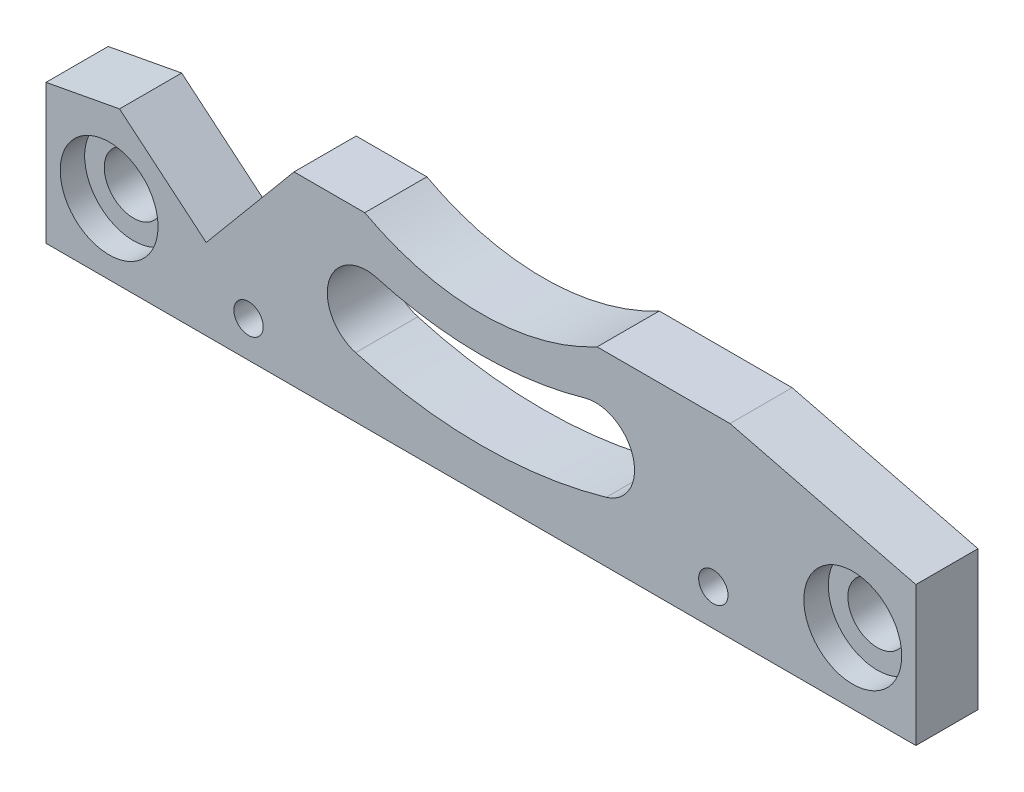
ISO-10303-21;
HEADER;
FILE_DESCRIPTION(('STEP AP214'),'2;1');
FILE_NAME('part.step','',(''),(''),'','','');
FILE_SCHEMA(('AUTOMOTIVE_DESIGN { 1 0 10303 214 1 1 1 1 }'));
ENDSEC;
DATA;
#1=APPLICATION_CONTEXT('core data for automotive mechanical design processes');
#2=APPLICATION_PROTOCOL_DEFINITION('international standard','automotive_design',2000,#1);
#3=PRODUCT_CONTEXT('',#1,'mechanical');
#4=PRODUCT('Part','Part','',(#3));
#5=PRODUCT_RELATED_PRODUCT_CATEGORY('part','',(#4));
#6=PRODUCT_DEFINITION_FORMATION('','',#4);
#7=PRODUCT_DEFINITION_CONTEXT('part definition',#1,'design');
#8=PRODUCT_DEFINITION('design','',#6,#7);
#9=PRODUCT_DEFINITION_SHAPE('','',#8);
#10=(LENGTH_UNIT() NAMED_UNIT(*) SI_UNIT(.MILLI.,.METRE.));
#11=(NAMED_UNIT(*) PLANE_ANGLE_UNIT() SI_UNIT($,.RADIAN.));
#12=(NAMED_UNIT(*) SI_UNIT($,.STERADIAN.) SOLID_ANGLE_UNIT());
#13=UNCERTAINTY_MEASURE_WITH_UNIT(LENGTH_MEASURE(1.E-05),#10,'distance_accuracy_value','');
#14=(GEOMETRIC_REPRESENTATION_CONTEXT(3) GLOBAL_UNCERTAINTY_ASSIGNED_CONTEXT((#13)) GLOBAL_UNIT_ASSIGNED_CONTEXT((#10,
#11,#12)) REPRESENTATION_CONTEXT('',''));
#15=CARTESIAN_POINT('',(0.,0.,0.));
#16=DIRECTION('',(0.,0.,1.));
#17=DIRECTION('',(1.,0.,0.));
#18=AXIS2_PLACEMENT_3D('',#15,#16,#17);
#19=CARTESIAN_POINT('',(25.45,19.,3.175));
#20=DIRECTION('',(0.,-1.,0.));
#21=DIRECTION('',(0.,0.,-1.));
#22=AXIS2_PLACEMENT_3D('',#19,#20,#21);
#23=PLANE('',#22);
#24=DIRECTION('',(-1.,0.,0.));
#25=VECTOR('',#24,1.);
#26=CARTESIAN_POINT('',(25.45,19.,-3.175));
#27=LINE('',#26,#25);
#28=CARTESIAN_POINT('',(25.45,19.,-3.175));
#29=VERTEX_POINT('',#28);
#30=CARTESIAN_POINT('',(11.8743420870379,19.,-3.175));
#31=VERTEX_POINT('',#30);
#32=EDGE_CURVE('E146',#29,#31,#27,.T.);
#33=ORIENTED_EDGE('',*,*,#32,.T.);
#34=DIRECTION('',(0.,0.,1.));
#35=VECTOR('',#34,1.);
#36=CARTESIAN_POINT('',(11.8743420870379,19.,-3.176));
#37=LINE('',#36,#35);
#38=CARTESIAN_POINT('',(11.8743420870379,19.,3.175));
#39=VERTEX_POINT('',#38);
#40=EDGE_CURVE('E47',#31,#39,#37,.T.);
#41=ORIENTED_EDGE('',*,*,#40,.T.);
#42=DIRECTION('',(-1.,0.,0.));
#43=VECTOR('',#42,1.);
#44=CARTESIAN_POINT('',(25.45,19.,3.175));
#45=LINE('',#44,#43);
#46=CARTESIAN_POINT('',(25.45,19.,3.175));
#47=VERTEX_POINT('',#46);
#48=EDGE_CURVE('E144',#47,#39,#45,.T.);
#49=ORIENTED_EDGE('',*,*,#48,.F.);
#50=DIRECTION('',(0.,0.,-1.));
#51=VECTOR('',#50,1.);
#52=CARTESIAN_POINT('',(25.45,19.,3.175));
#53=LINE('',#52,#51);
#54=EDGE_CURVE('E195',#47,#29,#53,.T.);
#55=ORIENTED_EDGE('',*,*,#54,.T.);
#56=EDGE_LOOP('',(#33,#41,#49,#55));
#57=FACE_BOUND('',#56,.T.);
#58=ADVANCED_FACE('F32',(#57),#23,.F.);
#59=CARTESIAN_POINT('',(-44.45,0.,3.175));
#60=DIRECTION('',(1.,0.,0.));
#61=DIRECTION('',(0.,0.,-1.));
#62=AXIS2_PLACEMENT_3D('',#59,#60,#61);
#63=PLANE('',#62);
#64=DIRECTION('',(0.,-1.,0.));
#65=VECTOR('',#64,1.);
#66=CARTESIAN_POINT('',(-44.45,0.,-3.175));
#67=LINE('',#66,#65);
#68=CARTESIAN_POINT('',(-44.45,14.25,-3.175));
#69=VERTEX_POINT('',#68);
#70=CARTESIAN_POINT('',(-44.45,0.,-3.175));
#71=VERTEX_POINT('',#70);
#72=EDGE_CURVE('E165',#69,#71,#67,.T.);
#73=ORIENTED_EDGE('',*,*,#72,.T.);
#74=DIRECTION('',(0.,0.,-1.));
#75=VECTOR('',#74,1.);
#76=CARTESIAN_POINT('',(-44.45,0.,3.175));
#77=LINE('',#76,#75);
#78=CARTESIAN_POINT('',(-44.45,0.,3.175));
#79=VERTEX_POINT('',#78);
#80=EDGE_CURVE('E11',#79,#71,#77,.T.);
#81=ORIENTED_EDGE('',*,*,#80,.F.);
#82=DIRECTION('',(0.,-1.,0.));
#83=VECTOR('',#82,1.);
#84=CARTESIAN_POINT('',(-44.45,0.,3.175));
#85=LINE('',#84,#83);
#86=CARTESIAN_POINT('',(-44.45,14.25,3.175));
#87=VERTEX_POINT('',#86);
#88=EDGE_CURVE('E183',#87,#79,#85,.T.);
#89=ORIENTED_EDGE('',*,*,#88,.F.);
#90=DIRECTION('',(0.,0.,-1.));
#91=VECTOR('',#90,1.);
#92=CARTESIAN_POINT('',(-44.45,14.25,3.175));
#93=LINE('',#92,#91);
#94=EDGE_CURVE('E164',#87,#69,#93,.T.);
#95=ORIENTED_EDGE('',*,*,#94,.T.);
#96=EDGE_LOOP('',(#73,#81,#89,#95));
#97=FACE_BOUND('',#96,.T.);
#98=ADVANCED_FACE('F34',(#97),#63,.F.);
#99=CARTESIAN_POINT('',(-44.45,0.,3.175));
#100=DIRECTION('',(0.,1.,0.));
#101=DIRECTION('',(0.,0.,1.));
#102=AXIS2_PLACEMENT_3D('',#99,#100,#101);
#103=PLANE('',#102);
#104=DIRECTION('',(1.,0.,0.));
#105=VECTOR('',#104,1.);
#106=CARTESIAN_POINT('',(-44.45,0.,-3.175));
#107=LINE('',#106,#105);
#108=CARTESIAN_POINT('',(44.45,0.,-3.175));
#109=VERTEX_POINT('',#108);
#110=EDGE_CURVE('E168',#71,#109,#107,.T.);
#111=ORIENTED_EDGE('',*,*,#110,.T.);
#112=DIRECTION('',(0.,0.,-1.));
#113=VECTOR('',#112,1.);
#114=CARTESIAN_POINT('',(44.45,0.,3.175));
#115=LINE('',#114,#113);
#116=CARTESIAN_POINT('',(44.45,0.,3.175));
#117=VERTEX_POINT('',#116);
#118=EDGE_CURVE('E40',#117,#109,#115,.T.);
#119=ORIENTED_EDGE('',*,*,#118,.F.);
#120=DIRECTION('',(1.,0.,0.));
#121=VECTOR('',#120,1.);
#122=CARTESIAN_POINT('',(-44.45,0.,3.175));
#123=LINE('',#122,#121);
#124=EDGE_CURVE('E215',#79,#117,#123,.T.);
#125=ORIENTED_EDGE('',*,*,#124,.F.);
#126=ORIENTED_EDGE('',*,*,#80,.T.);
#127=EDGE_LOOP('',(#111,#119,#125,#126));
#128=FACE_BOUND('',#127,.T.);
#129=ADVANCED_FACE('F306',(#128),#103,.F.);
#130=CARTESIAN_POINT('',(44.45,0.,3.175));
#131=DIRECTION('',(-1.,0.,0.));
#132=DIRECTION('',(0.,0.,1.));
#133=AXIS2_PLACEMENT_3D('',#130,#131,#132);
#134=PLANE('',#133);
#135=DIRECTION('',(0.,1.,0.));
#136=VECTOR('',#135,1.);
#137=CARTESIAN_POINT('',(44.45,0.,-3.175));
#138=LINE('',#137,#136);
#139=CARTESIAN_POINT('',(44.45,14.25,-3.175));
#140=VERTEX_POINT('',#139);
#141=EDGE_CURVE('E171',#109,#140,#138,.T.);
#142=ORIENTED_EDGE('',*,*,#141,.T.);
#143=DIRECTION('',(0.,0.,-1.));
#144=VECTOR('',#143,1.);
#145=CARTESIAN_POINT('',(44.45,14.25,3.175));
#146=LINE('',#145,#144);
#147=CARTESIAN_POINT('',(44.45,14.25,3.175));
#148=VERTEX_POINT('',#147);
#149=EDGE_CURVE('E197',#148,#140,#146,.T.);
#150=ORIENTED_EDGE('',*,*,#149,.F.);
#151=DIRECTION('',(0.,1.,0.));
#152=VECTOR('',#151,1.);
#153=CARTESIAN_POINT('',(44.45,0.,3.175));
#154=LINE('',#153,#152);
#155=EDGE_CURVE('E206',#117,#148,#154,.T.);
#156=ORIENTED_EDGE('',*,*,#155,.F.);
#157=ORIENTED_EDGE('',*,*,#118,.T.);
#158=EDGE_LOOP('',(#142,#150,#156,#157));
#159=FACE_BOUND('',#158,.T.);
#160=ADVANCED_FACE('F204',(#159),#134,.F.);
#161=CARTESIAN_POINT('',(44.45,14.25,3.175));
#162=DIRECTION('',(-0.242535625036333,-0.970142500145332,0.));
#163=DIRECTION('',(0.970142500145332,-0.242535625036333,0.));
#164=AXIS2_PLACEMENT_3D('',#161,#162,#163);
#165=PLANE('',#164);
#166=DIRECTION('',(-0.970142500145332,0.242535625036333,0.));
#167=VECTOR('',#166,1.);
#168=CARTESIAN_POINT('',(44.45,14.25,-3.175));
#169=LINE('',#168,#167);
#170=EDGE_CURVE('E173',#140,#29,#169,.T.);
#171=ORIENTED_EDGE('',*,*,#170,.T.);
#172=ORIENTED_EDGE('',*,*,#54,.F.);
#173=DIRECTION('',(-0.970142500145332,0.242535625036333,0.));
#174=VECTOR('',#173,1.);
#175=CARTESIAN_POINT('',(44.45,14.25,3.175));
#176=LINE('',#175,#174);
#177=EDGE_CURVE('E151',#148,#47,#176,.T.);
#178=ORIENTED_EDGE('',*,*,#177,.F.);
#179=ORIENTED_EDGE('',*,*,#149,.T.);
#180=EDGE_LOOP('',(#171,#172,#178,#179));
#181=FACE_BOUND('',#180,.T.);
#182=ADVANCED_FACE('F214',(#181),#165,.F.);
#183=CARTESIAN_POINT('',(-11.8743420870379,19.,3.175));
#184=VERTEX_POINT('',#183);
#185=CARTESIAN_POINT('',(-19.1,19.,3.175));
#186=VERTEX_POINT('',#185);
#187=EDGE_CURVE('E154',#184,#186,#45,.T.);
#188=ORIENTED_EDGE('',*,*,#187,.F.);
#189=DIRECTION('',(0.,0.,1.));
#190=VECTOR('',#189,1.);
#191=CARTESIAN_POINT('',(-11.8743420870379,19.,-3.176));
#192=LINE('',#191,#190);
#193=CARTESIAN_POINT('',(-11.8743420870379,19.,-3.175));
#194=VERTEX_POINT('',#193);
#195=EDGE_CURVE('E134',#194,#184,#192,.T.);
#196=ORIENTED_EDGE('',*,*,#195,.F.);
#197=CARTESIAN_POINT('',(-19.1,19.,-3.175));
#198=VERTEX_POINT('',#197);
#199=EDGE_CURVE('E175',#194,#198,#27,.T.);
#200=ORIENTED_EDGE('',*,*,#199,.T.);
#201=DIRECTION('',(0.,0.,-1.));
#202=VECTOR('',#201,1.);
#203=CARTESIAN_POINT('',(-19.1,19.,3.175));
#204=LINE('',#203,#202);
#205=EDGE_CURVE('E192',#186,#198,#204,.T.);
#206=ORIENTED_EDGE('',*,*,#205,.F.);
#207=EDGE_LOOP('',(#188,#196,#200,#206));
#208=FACE_BOUND('',#207,.T.);
#209=ADVANCED_FACE('F286',(#208),#23,.F.);
#210=CARTESIAN_POINT('',(-28.0778892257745,8.25767692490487,3.175));
#211=DIRECTION('',(0.767308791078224,-0.641277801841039,0.));
#212=DIRECTION('',(0.641277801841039,0.767308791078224,0.));
#213=AXIS2_PLACEMENT_3D('',#210,#211,#212);
#214=PLANE('',#213);
#215=DIRECTION('',(-0.641277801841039,-0.767308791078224,0.));
#216=VECTOR('',#215,1.);
#217=CARTESIAN_POINT('',(-28.0778892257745,8.25767692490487,-3.175));
#218=LINE('',#217,#216);
#219=CARTESIAN_POINT('',(-28.0778892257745,8.25767692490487,-3.175));
#220=VERTEX_POINT('',#219);
#221=EDGE_CURVE('E177',#198,#220,#218,.T.);
#222=ORIENTED_EDGE('',*,*,#221,.T.);
#223=DIRECTION('',(0.,0.,-1.));
#224=VECTOR('',#223,1.);
#225=CARTESIAN_POINT('',(-28.0778892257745,8.25767692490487,3.175));
#226=LINE('',#225,#224);
#227=CARTESIAN_POINT('',(-28.0778892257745,8.25767692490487,3.175));
#228=VERTEX_POINT('',#227);
#229=EDGE_CURVE('E189',#228,#220,#226,.T.);
#230=ORIENTED_EDGE('',*,*,#229,.F.);
#231=DIRECTION('',(-0.641277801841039,-0.767308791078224,0.));
#232=VECTOR('',#231,1.);
#233=CARTESIAN_POINT('',(-28.0778892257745,8.25767692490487,3.175));
#234=LINE('',#233,#232);
#235=EDGE_CURVE('E153',#186,#228,#234,.T.);
#236=ORIENTED_EDGE('',*,*,#235,.F.);
#237=ORIENTED_EDGE('',*,*,#205,.T.);
#238=EDGE_LOOP('',(#222,#230,#236,#237));
#239=FACE_BOUND('',#238,.T.);
#240=ADVANCED_FACE('F293',(#239),#214,.F.);
#241=CARTESIAN_POINT('',(-36.9331770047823,15.6584776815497,3.175));
#242=DIRECTION('',(-0.641277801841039,-0.767308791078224,0.));
#243=DIRECTION('',(0.767308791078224,-0.641277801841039,0.));
#244=AXIS2_PLACEMENT_3D('',#241,#242,#243);
#245=PLANE('',#244);
#246=DIRECTION('',(-0.767308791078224,0.641277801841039,0.));
#247=VECTOR('',#246,1.);
#248=CARTESIAN_POINT('',(-36.9331770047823,15.6584776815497,-3.175));
#249=LINE('',#248,#247);
#250=CARTESIAN_POINT('',(-36.9331770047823,15.6584776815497,-3.175));
#251=VERTEX_POINT('',#250);
#252=EDGE_CURVE('E179',#220,#251,#249,.T.);
#253=ORIENTED_EDGE('',*,*,#252,.T.);
#254=DIRECTION('',(0.,0.,-1.));
#255=VECTOR('',#254,1.);
#256=CARTESIAN_POINT('',(-36.9331770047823,15.6584776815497,3.175));
#257=LINE('',#256,#255);
#258=CARTESIAN_POINT('',(-36.9331770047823,15.6584776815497,3.175));
#259=VERTEX_POINT('',#258);
#260=EDGE_CURVE('E186',#259,#251,#257,.T.);
#261=ORIENTED_EDGE('',*,*,#260,.F.);
#262=DIRECTION('',(-0.767308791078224,0.641277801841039,0.));
#263=VECTOR('',#262,1.);
#264=CARTESIAN_POINT('',(-36.9331770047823,15.6584776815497,3.175));
#265=LINE('',#264,#263);
#266=EDGE_CURVE('E156',#228,#259,#265,.T.);
#267=ORIENTED_EDGE('',*,*,#266,.F.);
#268=ORIENTED_EDGE('',*,*,#229,.T.);
#269=EDGE_LOOP('',(#253,#261,#267,#268));
#270=FACE_BOUND('',#269,.T.);
#271=ADVANCED_FACE('F297',(#270),#245,.F.);
#272=CARTESIAN_POINT('',(-44.45,14.25,3.175));
#273=DIRECTION('',(0.184171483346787,-0.982894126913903,0.));
#274=DIRECTION('',(0.982894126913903,0.184171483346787,0.));
#275=AXIS2_PLACEMENT_3D('',#272,#273,#274);
#276=PLANE('',#275);
#277=DIRECTION('',(-0.982894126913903,-0.184171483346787,0.));
#278=VECTOR('',#277,1.);
#279=CARTESIAN_POINT('',(-44.45,14.25,-3.175));
#280=LINE('',#279,#278);
#281=EDGE_CURVE('E181',#251,#69,#280,.T.);
#282=ORIENTED_EDGE('',*,*,#281,.T.);
#283=ORIENTED_EDGE('',*,*,#94,.F.);
#284=DIRECTION('',(-0.982894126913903,-0.184171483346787,0.));
#285=VECTOR('',#284,1.);
#286=CARTESIAN_POINT('',(-44.45,14.25,3.175));
#287=LINE('',#286,#285);
#288=EDGE_CURVE('E162',#259,#87,#287,.T.);
#289=ORIENTED_EDGE('',*,*,#288,.F.);
#290=ORIENTED_EDGE('',*,*,#260,.T.);
#291=EDGE_LOOP('',(#282,#283,#289,#290));
#292=FACE_BOUND('',#291,.T.);
#293=ADVANCED_FACE('F304',(#292),#276,.F.);
#294=CARTESIAN_POINT('',(0.,0.,3.175));
#295=DIRECTION('',(0.,0.,1.));
#296=DIRECTION('',(1.,0.,0.));
#297=AXIS2_PLACEMENT_3D('',#294,#295,#296);
#298=PLANE('',#297);
#299=CARTESIAN_POINT('',(0.,41.,3.175));
#300=DIRECTION('',(0.,0.,1.));
#301=DIRECTION('',(1.,0.,0.));
#302=AXIS2_PLACEMENT_3D('',#299,#300,#301);
#303=CIRCLE('',#302,25.);
#304=EDGE_CURVE('E131',#184,#39,#303,.T.);
#305=ORIENTED_EDGE('',*,*,#304,.F.);
#306=ORIENTED_EDGE('',*,*,#187,.T.);
#307=ORIENTED_EDGE('',*,*,#235,.T.);
#308=ORIENTED_EDGE('',*,*,#266,.T.);
#309=ORIENTED_EDGE('',*,*,#288,.T.);
#310=ORIENTED_EDGE('',*,*,#88,.T.);
#311=ORIENTED_EDGE('',*,*,#124,.T.);
#312=ORIENTED_EDGE('',*,*,#155,.T.);
#313=ORIENTED_EDGE('',*,*,#177,.T.);
#314=ORIENTED_EDGE('',*,*,#48,.T.);
#315=EDGE_LOOP('',(#305,#306,#307,#308,#309,#310,#311,#312,#313,#314));
#316=FACE_BOUND('',#315,.T.);
#317=CARTESIAN_POINT('',(-11.7008057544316,9.99444100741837,3.175));
#318=DIRECTION('',(0.,0.,1.));
#319=DIRECTION('',(1.,0.,0.));
#320=AXIS2_PLACEMENT_3D('',#317,#318,#319);
#321=CIRCLE('',#320,4.);
#322=CARTESIAN_POINT('',(-10.5982563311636,13.8394877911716,3.175));
#323=VERTEX_POINT('',#322);
#324=CARTESIAN_POINT('',(-12.8033551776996,6.1493942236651,3.175));
#325=VERTEX_POINT('',#324);
#326=EDGE_CURVE('E55',#323,#325,#321,.T.);
#327=ORIENTED_EDGE('',*,*,#326,.F.);
#328=CARTESIAN_POINT('',(0.,50.8,3.175));
#329=DIRECTION('',(0.,0.,-1.));
#330=DIRECTION('',(1.,0.,0.));
#331=AXIS2_PLACEMENT_3D('',#328,#329,#330);
#332=CIRCLE('',#331,38.45);
#333=CARTESIAN_POINT('',(10.5982563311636,13.8394877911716,3.175));
#334=VERTEX_POINT('',#333);
#335=EDGE_CURVE('E262',#334,#323,#332,.T.);
#336=ORIENTED_EDGE('',*,*,#335,.F.);
#337=CARTESIAN_POINT('',(11.7008057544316,9.99444100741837,3.175));
#338=DIRECTION('',(0.,0.,1.));
#339=DIRECTION('',(1.,0.,0.));
#340=AXIS2_PLACEMENT_3D('',#337,#338,#339);
#341=CIRCLE('',#340,4.);
#342=CARTESIAN_POINT('',(12.8033551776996,6.14939422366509,3.175));
#343=VERTEX_POINT('',#342);
#344=EDGE_CURVE('E269',#343,#334,#341,.T.);
#345=ORIENTED_EDGE('',*,*,#344,.F.);
#346=CARTESIAN_POINT('',(0.,50.8,3.175));
#347=DIRECTION('',(0.,0.,1.));
#348=DIRECTION('',(1.,0.,0.));
#349=AXIS2_PLACEMENT_3D('',#346,#347,#348);
#350=CIRCLE('',#349,46.45);
#351=EDGE_CURVE('E272',#325,#343,#350,.T.);
#352=ORIENTED_EDGE('',*,*,#351,.F.);
#353=EDGE_LOOP('',(#327,#336,#345,#352));
#354=FACE_BOUND('',#353,.T.);
#355=CARTESIAN_POINT('',(23.75,3.7,3.175));
#356=DIRECTION('',(0.,0.,1.));
#357=DIRECTION('',(1.,0.,0.));
#358=AXIS2_PLACEMENT_3D('',#355,#356,#357);
#359=CIRCLE('',#358,1.49999999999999);
#360=CARTESIAN_POINT('',(25.25,3.7,3.175));
#361=VERTEX_POINT('',#360);
#362=EDGE_CURVE('E252',#361,#361,#359,.T.);
#363=ORIENTED_EDGE('',*,*,#362,.F.);
#364=EDGE_LOOP('',(#363));
#365=FACE_BOUND('',#364,.T.);
#366=CARTESIAN_POINT('',(-23.75,3.7,3.175));
#367=DIRECTION('',(0.,0.,1.));
#368=DIRECTION('',(1.,0.,0.));
#369=AXIS2_PLACEMENT_3D('',#366,#367,#368);
#370=CIRCLE('',#369,1.49999999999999);
#371=CARTESIAN_POINT('',(-22.25,3.7,3.175));
#372=VERTEX_POINT('',#371);
#373=EDGE_CURVE('E246',#372,#372,#370,.T.);
#374=ORIENTED_EDGE('',*,*,#373,.F.);
#375=EDGE_LOOP('',(#374));
#376=FACE_BOUND('',#375,.T.);
#377=CARTESIAN_POINT('',(38.,7.2,3.175));
#378=DIRECTION('',(0.,0.,1.));
#379=DIRECTION('',(1.,0.,0.));
#380=AXIS2_PLACEMENT_3D('',#377,#378,#379);
#381=CIRCLE('',#380,5.);
#382=CARTESIAN_POINT('',(43.,7.2,3.175));
#383=VERTEX_POINT('',#382);
#384=EDGE_CURVE('E240',#383,#383,#381,.T.);
#385=ORIENTED_EDGE('',*,*,#384,.F.);
#386=EDGE_LOOP('',(#385));
#387=FACE_BOUND('',#386,.T.);
#388=CARTESIAN_POINT('',(-38.,7.2,3.175));
#389=DIRECTION('',(0.,0.,1.));
#390=DIRECTION('',(1.,0.,0.));
#391=AXIS2_PLACEMENT_3D('',#388,#389,#390);
#392=CIRCLE('',#391,5.);
#393=CARTESIAN_POINT('',(-33.,7.2,3.175));
#394=VERTEX_POINT('',#393);
#395=EDGE_CURVE('E228',#394,#394,#392,.T.);
#396=ORIENTED_EDGE('',*,*,#395,.F.);
#397=EDGE_LOOP('',(#396));
#398=FACE_BOUND('',#397,.T.);
#399=ADVANCED_FACE('F148',(#316,#354,#365,#376,#387,#398),#298,.T.);
#400=CARTESIAN_POINT('',(0.,0.,-3.175));
#401=DIRECTION('',(0.,0.,1.));
#402=DIRECTION('',(1.,0.,0.));
#403=AXIS2_PLACEMENT_3D('',#400,#401,#402);
#404=PLANE('',#403);
#405=CARTESIAN_POINT('',(0.,50.8,-3.175));
#406=DIRECTION('',(0.,0.,1.));
#407=DIRECTION('',(1.,0.,0.));
#408=AXIS2_PLACEMENT_3D('',#405,#406,#407);
#409=CIRCLE('',#408,38.45);
#410=CARTESIAN_POINT('',(-10.5982563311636,13.8394877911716,-3.175));
#411=VERTEX_POINT('',#410);
#412=CARTESIAN_POINT('',(10.5982563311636,13.8394877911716,-3.175));
#413=VERTEX_POINT('',#412);
#414=EDGE_CURVE('E279',#411,#413,#409,.T.);
#415=ORIENTED_EDGE('',*,*,#414,.F.);
#416=CARTESIAN_POINT('',(-11.7008057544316,9.99444100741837,-3.175));
#417=DIRECTION('',(0.,0.,1.));
#418=DIRECTION('',(1.,0.,0.));
#419=AXIS2_PLACEMENT_3D('',#416,#417,#418);
#420=CIRCLE('',#419,4.);
#421=CARTESIAN_POINT('',(-12.8033551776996,6.1493942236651,-3.175));
#422=VERTEX_POINT('',#421);
#423=EDGE_CURVE('E276',#422,#411,#420,.F.);
#424=ORIENTED_EDGE('',*,*,#423,.F.);
#425=CARTESIAN_POINT('',(0.,50.8,-3.175));
#426=DIRECTION('',(0.,0.,1.));
#427=DIRECTION('',(1.,0.,0.));
#428=AXIS2_PLACEMENT_3D('',#425,#426,#427);
#429=CIRCLE('',#428,46.45);
#430=CARTESIAN_POINT('',(12.8033551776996,6.14939422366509,-3.175));
#431=VERTEX_POINT('',#430);
#432=EDGE_CURVE('E255',#431,#422,#429,.F.);
#433=ORIENTED_EDGE('',*,*,#432,.F.);
#434=CARTESIAN_POINT('',(11.7008057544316,9.99444100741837,-3.175));
#435=DIRECTION('',(0.,0.,1.));
#436=DIRECTION('',(1.,0.,0.));
#437=AXIS2_PLACEMENT_3D('',#434,#435,#436);
#438=CIRCLE('',#437,4.);
#439=EDGE_CURVE('E282',#413,#431,#438,.F.);
#440=ORIENTED_EDGE('',*,*,#439,.F.);
#441=EDGE_LOOP('',(#415,#424,#433,#440));
#442=FACE_BOUND('',#441,.T.);
#443=CARTESIAN_POINT('',(23.75,3.7,-3.175));
#444=DIRECTION('',(0.,0.,1.));
#445=DIRECTION('',(1.,0.,0.));
#446=AXIS2_PLACEMENT_3D('',#443,#444,#445);
#447=CIRCLE('',#446,1.5);
#448=CARTESIAN_POINT('',(25.25,3.7,-3.175));
#449=VERTEX_POINT('',#448);
#450=EDGE_CURVE('E249',#449,#449,#447,.T.);
#451=ORIENTED_EDGE('',*,*,#450,.T.);
#452=EDGE_LOOP('',(#451));
#453=FACE_BOUND('',#452,.T.);
#454=CARTESIAN_POINT('',(-23.75,3.7,-3.175));
#455=DIRECTION('',(0.,0.,1.));
#456=DIRECTION('',(1.,0.,0.));
#457=AXIS2_PLACEMENT_3D('',#454,#455,#456);
#458=CIRCLE('',#457,1.5);
#459=CARTESIAN_POINT('',(-22.25,3.7,-3.175));
#460=VERTEX_POINT('',#459);
#461=EDGE_CURVE('E243',#460,#460,#458,.T.);
#462=ORIENTED_EDGE('',*,*,#461,.T.);
#463=EDGE_LOOP('',(#462));
#464=FACE_BOUND('',#463,.T.);
#465=CARTESIAN_POINT('',(38.,7.2,-3.175));
#466=DIRECTION('',(0.,0.,1.));
#467=DIRECTION('',(1.,0.,0.));
#468=AXIS2_PLACEMENT_3D('',#465,#466,#467);
#469=CIRCLE('',#468,3.);
#470=CARTESIAN_POINT('',(41.,7.2,-3.175));
#471=VERTEX_POINT('',#470);
#472=EDGE_CURVE('E231',#471,#471,#469,.T.);
#473=ORIENTED_EDGE('',*,*,#472,.T.);
#474=EDGE_LOOP('',(#473));
#475=FACE_BOUND('',#474,.T.);
#476=CARTESIAN_POINT('',(-38.,7.2,-3.175));
#477=DIRECTION('',(0.,0.,1.));
#478=DIRECTION('',(1.,0.,0.));
#479=AXIS2_PLACEMENT_3D('',#476,#477,#478);
#480=CIRCLE('',#479,3.);
#481=CARTESIAN_POINT('',(-35.,7.2,-3.175));
#482=VERTEX_POINT('',#481);
#483=EDGE_CURVE('E169',#482,#482,#480,.T.);
#484=ORIENTED_EDGE('',*,*,#483,.T.);
#485=EDGE_LOOP('',(#484));
#486=FACE_BOUND('',#485,.T.);
#487=ORIENTED_EDGE('',*,*,#199,.F.);
#488=CARTESIAN_POINT('',(0.,41.,-3.175));
#489=DIRECTION('',(0.,0.,1.));
#490=DIRECTION('',(1.,0.,0.));
#491=AXIS2_PLACEMENT_3D('',#488,#489,#490);
#492=CIRCLE('',#491,25.);
#493=EDGE_CURVE('E138',#31,#194,#492,.F.);
#494=ORIENTED_EDGE('',*,*,#493,.F.);
#495=ORIENTED_EDGE('',*,*,#32,.F.);
#496=ORIENTED_EDGE('',*,*,#170,.F.);
#497=ORIENTED_EDGE('',*,*,#141,.F.);
#498=ORIENTED_EDGE('',*,*,#110,.F.);
#499=ORIENTED_EDGE('',*,*,#72,.F.);
#500=ORIENTED_EDGE('',*,*,#281,.F.);
#501=ORIENTED_EDGE('',*,*,#252,.F.);
#502=ORIENTED_EDGE('',*,*,#221,.F.);
#503=EDGE_LOOP('',(#487,#494,#495,#496,#497,#498,#499,#500,#501,#502));
#504=FACE_BOUND('',#503,.T.);
#505=ADVANCED_FACE('F211',(#442,#453,#464,#475,#486,#504),#404,.F.);
#506=CARTESIAN_POINT('',(-38.,7.2,3.175));
#507=DIRECTION('',(0.,0.,1.));
#508=DIRECTION('',(1.,0.,0.));
#509=AXIS2_PLACEMENT_3D('',#506,#507,#508);
#510=CYLINDRICAL_SURFACE('',#509,3.);
#511=ORIENTED_EDGE('',*,*,#483,.F.);
#512=EDGE_LOOP('',(#511));
#513=FACE_BOUND('',#512,.T.);
#514=CARTESIAN_POINT('',(-38.,7.2,0.675));
#515=DIRECTION('',(0.,0.,1.));
#516=DIRECTION('',(1.,0.,0.));
#517=AXIS2_PLACEMENT_3D('',#514,#515,#516);
#518=CIRCLE('',#517,3.);
#519=CARTESIAN_POINT('',(-35.,7.2,0.675));
#520=VERTEX_POINT('',#519);
#521=EDGE_CURVE('E222',#520,#520,#518,.T.);
#522=ORIENTED_EDGE('',*,*,#521,.T.);
#523=EDGE_LOOP('',(#522));
#524=FACE_BOUND('',#523,.T.);
#525=ADVANCED_FACE('F383',(#513,#524),#510,.F.);
#526=CARTESIAN_POINT('',(-35.,7.2,0.675));
#527=DIRECTION('',(0.,0.,-1.));
#528=DIRECTION('',(-1.,0.,0.));
#529=AXIS2_PLACEMENT_3D('',#526,#527,#528);
#530=PLANE('',#529);
#531=ORIENTED_EDGE('',*,*,#521,.F.);
#532=EDGE_LOOP('',(#531));
#533=FACE_BOUND('',#532,.T.);
#534=CARTESIAN_POINT('',(-38.,7.2,0.675));
#535=DIRECTION('',(0.,0.,1.));
#536=DIRECTION('',(1.,0.,0.));
#537=AXIS2_PLACEMENT_3D('',#534,#535,#536);
#538=CIRCLE('',#537,5.);
#539=CARTESIAN_POINT('',(-33.,7.2,0.675));
#540=VERTEX_POINT('',#539);
#541=EDGE_CURVE('E225',#540,#540,#538,.T.);
#542=ORIENTED_EDGE('',*,*,#541,.T.);
#543=EDGE_LOOP('',(#542));
#544=FACE_BOUND('',#543,.T.);
#545=ADVANCED_FACE('F392',(#533,#544),#530,.F.);
#546=CARTESIAN_POINT('',(-38.,7.2,3.175));
#547=DIRECTION('',(0.,0.,1.));
#548=DIRECTION('',(1.,0.,0.));
#549=AXIS2_PLACEMENT_3D('',#546,#547,#548);
#550=CYLINDRICAL_SURFACE('',#549,5.);
#551=ORIENTED_EDGE('',*,*,#541,.F.);
#552=EDGE_LOOP('',(#551));
#553=FACE_BOUND('',#552,.T.);
#554=ORIENTED_EDGE('',*,*,#395,.T.);
#555=EDGE_LOOP('',(#554));
#556=FACE_BOUND('',#555,.T.);
#557=ADVANCED_FACE('F401',(#553,#556),#550,.F.);
#558=CARTESIAN_POINT('',(38.,7.2,3.175));
#559=DIRECTION('',(0.,0.,1.));
#560=DIRECTION('',(1.,0.,0.));
#561=AXIS2_PLACEMENT_3D('',#558,#559,#560);
#562=CYLINDRICAL_SURFACE('',#561,3.);
#563=ORIENTED_EDGE('',*,*,#472,.F.);
#564=EDGE_LOOP('',(#563));
#565=FACE_BOUND('',#564,.T.);
#566=CARTESIAN_POINT('',(38.,7.2,0.675));
#567=DIRECTION('',(0.,0.,1.));
#568=DIRECTION('',(1.,0.,0.));
#569=AXIS2_PLACEMENT_3D('',#566,#567,#568);
#570=CIRCLE('',#569,3.);
#571=CARTESIAN_POINT('',(41.,7.2,0.675));
#572=VERTEX_POINT('',#571);
#573=EDGE_CURVE('E234',#572,#572,#570,.T.);
#574=ORIENTED_EDGE('',*,*,#573,.T.);
#575=EDGE_LOOP('',(#574));
#576=FACE_BOUND('',#575,.T.);
#577=ADVANCED_FACE('F410',(#565,#576),#562,.F.);
#578=CARTESIAN_POINT('',(41.,7.2,0.675));
#579=DIRECTION('',(0.,0.,-1.));
#580=DIRECTION('',(-1.,0.,0.));
#581=AXIS2_PLACEMENT_3D('',#578,#579,#580);
#582=PLANE('',#581);
#583=ORIENTED_EDGE('',*,*,#573,.F.);
#584=EDGE_LOOP('',(#583));
#585=FACE_BOUND('',#584,.T.);
#586=CARTESIAN_POINT('',(38.,7.2,0.675));
#587=DIRECTION('',(0.,0.,1.));
#588=DIRECTION('',(1.,0.,0.));
#589=AXIS2_PLACEMENT_3D('',#586,#587,#588);
#590=CIRCLE('',#589,5.);
#591=CARTESIAN_POINT('',(43.,7.2,0.675));
#592=VERTEX_POINT('',#591);
#593=EDGE_CURVE('E237',#592,#592,#590,.T.);
#594=ORIENTED_EDGE('',*,*,#593,.T.);
#595=EDGE_LOOP('',(#594));
#596=FACE_BOUND('',#595,.T.);
#597=ADVANCED_FACE('F419',(#585,#596),#582,.F.);
#598=CARTESIAN_POINT('',(38.,7.2,3.175));
#599=DIRECTION('',(0.,0.,1.));
#600=DIRECTION('',(1.,0.,0.));
#601=AXIS2_PLACEMENT_3D('',#598,#599,#600);
#602=CYLINDRICAL_SURFACE('',#601,5.);
#603=ORIENTED_EDGE('',*,*,#593,.F.);
#604=EDGE_LOOP('',(#603));
#605=FACE_BOUND('',#604,.T.);
#606=ORIENTED_EDGE('',*,*,#384,.T.);
#607=EDGE_LOOP('',(#606));
#608=FACE_BOUND('',#607,.T.);
#609=ADVANCED_FACE('F428',(#605,#608),#602,.F.);
#610=CARTESIAN_POINT('',(-23.75,3.7,3.175));
#611=DIRECTION('',(0.,0.,1.));
#612=DIRECTION('',(1.,0.,0.));
#613=AXIS2_PLACEMENT_3D('',#610,#611,#612);
#614=CYLINDRICAL_SURFACE('',#613,1.49999999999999);
#615=ORIENTED_EDGE('',*,*,#461,.F.);
#616=EDGE_LOOP('',(#615));
#617=FACE_BOUND('',#616,.T.);
#618=ORIENTED_EDGE('',*,*,#373,.T.);
#619=EDGE_LOOP('',(#618));
#620=FACE_BOUND('',#619,.T.);
#621=ADVANCED_FACE('F437',(#617,#620),#614,.F.);
#622=CARTESIAN_POINT('',(23.75,3.7,3.175));
#623=DIRECTION('',(0.,0.,1.));
#624=DIRECTION('',(1.,0.,0.));
#625=AXIS2_PLACEMENT_3D('',#622,#623,#624);
#626=CYLINDRICAL_SURFACE('',#625,1.49999999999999);
#627=ORIENTED_EDGE('',*,*,#450,.F.);
#628=EDGE_LOOP('',(#627));
#629=FACE_BOUND('',#628,.T.);
#630=ORIENTED_EDGE('',*,*,#362,.T.);
#631=EDGE_LOOP('',(#630));
#632=FACE_BOUND('',#631,.T.);
#633=ADVANCED_FACE('F446',(#629,#632),#626,.F.);
#634=CARTESIAN_POINT('',(-11.7008057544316,9.99444100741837,-3.176));
#635=DIRECTION('',(0.,0.,1.));
#636=DIRECTION('',(1.,0.,0.));
#637=AXIS2_PLACEMENT_3D('',#634,#635,#636);
#638=CYLINDRICAL_SURFACE('',#637,4.);
#639=ORIENTED_EDGE('',*,*,#423,.T.);
#640=DIRECTION('',(0.,0.,1.));
#641=VECTOR('',#640,1.);
#642=CARTESIAN_POINT('',(-10.5982563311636,13.8394877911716,-3.176));
#643=LINE('',#642,#641);
#644=EDGE_CURVE('E258',#411,#323,#643,.T.);
#645=ORIENTED_EDGE('',*,*,#644,.T.);
#646=ORIENTED_EDGE('',*,*,#326,.T.);
#647=DIRECTION('',(0.,0.,1.));
#648=VECTOR('',#647,1.);
#649=CARTESIAN_POINT('',(-12.8033551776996,6.1493942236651,-3.176));
#650=LINE('',#649,#648);
#651=EDGE_CURVE('E259',#422,#325,#650,.T.);
#652=ORIENTED_EDGE('',*,*,#651,.F.);
#653=EDGE_LOOP('',(#639,#645,#646,#652));
#654=FACE_BOUND('',#653,.T.);
#655=ADVANCED_FACE('F455',(#654),#638,.F.);
#656=CARTESIAN_POINT('',(0.,50.8,-3.176));
#657=DIRECTION('',(0.,0.,1.));
#658=DIRECTION('',(1.,0.,0.));
#659=AXIS2_PLACEMENT_3D('',#656,#657,#658);
#660=CYLINDRICAL_SURFACE('',#659,38.45);
#661=ORIENTED_EDGE('',*,*,#414,.T.);
#662=DIRECTION('',(0.,0.,1.));
#663=VECTOR('',#662,1.);
#664=CARTESIAN_POINT('',(10.5982563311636,13.8394877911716,-3.176));
#665=LINE('',#664,#663);
#666=EDGE_CURVE('E264',#413,#334,#665,.T.);
#667=ORIENTED_EDGE('',*,*,#666,.T.);
#668=ORIENTED_EDGE('',*,*,#335,.T.);
#669=ORIENTED_EDGE('',*,*,#644,.F.);
#670=EDGE_LOOP('',(#661,#667,#668,#669));
#671=FACE_BOUND('',#670,.T.);
#672=ADVANCED_FACE('F464',(#671),#660,.T.);
#673=CARTESIAN_POINT('',(11.7008057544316,9.99444100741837,-3.176));
#674=DIRECTION('',(0.,0.,1.));
#675=DIRECTION('',(1.,0.,0.));
#676=AXIS2_PLACEMENT_3D('',#673,#674,#675);
#677=CYLINDRICAL_SURFACE('',#676,4.);
#678=ORIENTED_EDGE('',*,*,#439,.T.);
#679=DIRECTION('',(0.,0.,1.));
#680=VECTOR('',#679,1.);
#681=CARTESIAN_POINT('',(12.8033551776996,6.14939422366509,-3.176));
#682=LINE('',#681,#680);
#683=EDGE_CURVE('E261',#431,#343,#682,.T.);
#684=ORIENTED_EDGE('',*,*,#683,.T.);
#685=ORIENTED_EDGE('',*,*,#344,.T.);
#686=ORIENTED_EDGE('',*,*,#666,.F.);
#687=EDGE_LOOP('',(#678,#684,#685,#686));
#688=FACE_BOUND('',#687,.T.);
#689=ADVANCED_FACE('F472',(#688),#677,.F.);
#690=CARTESIAN_POINT('',(0.,50.8,-3.176));
#691=DIRECTION('',(0.,0.,1.));
#692=DIRECTION('',(1.,0.,0.));
#693=AXIS2_PLACEMENT_3D('',#690,#691,#692);
#694=CYLINDRICAL_SURFACE('',#693,46.45);
#695=ORIENTED_EDGE('',*,*,#432,.T.);
#696=ORIENTED_EDGE('',*,*,#651,.T.);
#697=ORIENTED_EDGE('',*,*,#351,.T.);
#698=ORIENTED_EDGE('',*,*,#683,.F.);
#699=EDGE_LOOP('',(#695,#696,#697,#698));
#700=FACE_BOUND('',#699,.T.);
#701=ADVANCED_FACE('F481',(#700),#694,.F.);
#702=CARTESIAN_POINT('',(0.,41.,-3.176));
#703=DIRECTION('',(0.,0.,1.));
#704=DIRECTION('',(1.,0.,0.));
#705=AXIS2_PLACEMENT_3D('',#702,#703,#704);
#706=CYLINDRICAL_SURFACE('',#705,25.);
#707=ORIENTED_EDGE('',*,*,#493,.T.);
#708=ORIENTED_EDGE('',*,*,#195,.T.);
#709=ORIENTED_EDGE('',*,*,#304,.T.);
#710=ORIENTED_EDGE('',*,*,#40,.F.);
#711=EDGE_LOOP('',(#707,#708,#709,#710));
#712=FACE_BOUND('',#711,.T.);
#713=ADVANCED_FACE('F132',(#712),#706,.F.);
#714=CLOSED_SHELL('',(#58,#98,#129,#160,#182,#209,#240,#271,#293,#399,#505,#525,#545,#557,#577,
#597,#609,#621,#633,#655,#672,#689,#701,#713));
#715=MANIFOLD_SOLID_BREP('B2',#714);
#716=ADVANCED_BREP_SHAPE_REPRESENTATION('',(#18,#715),#14);
#717=SHAPE_DEFINITION_REPRESENTATION(#9,#716);
ENDSEC;
END-ISO-10303-21;
